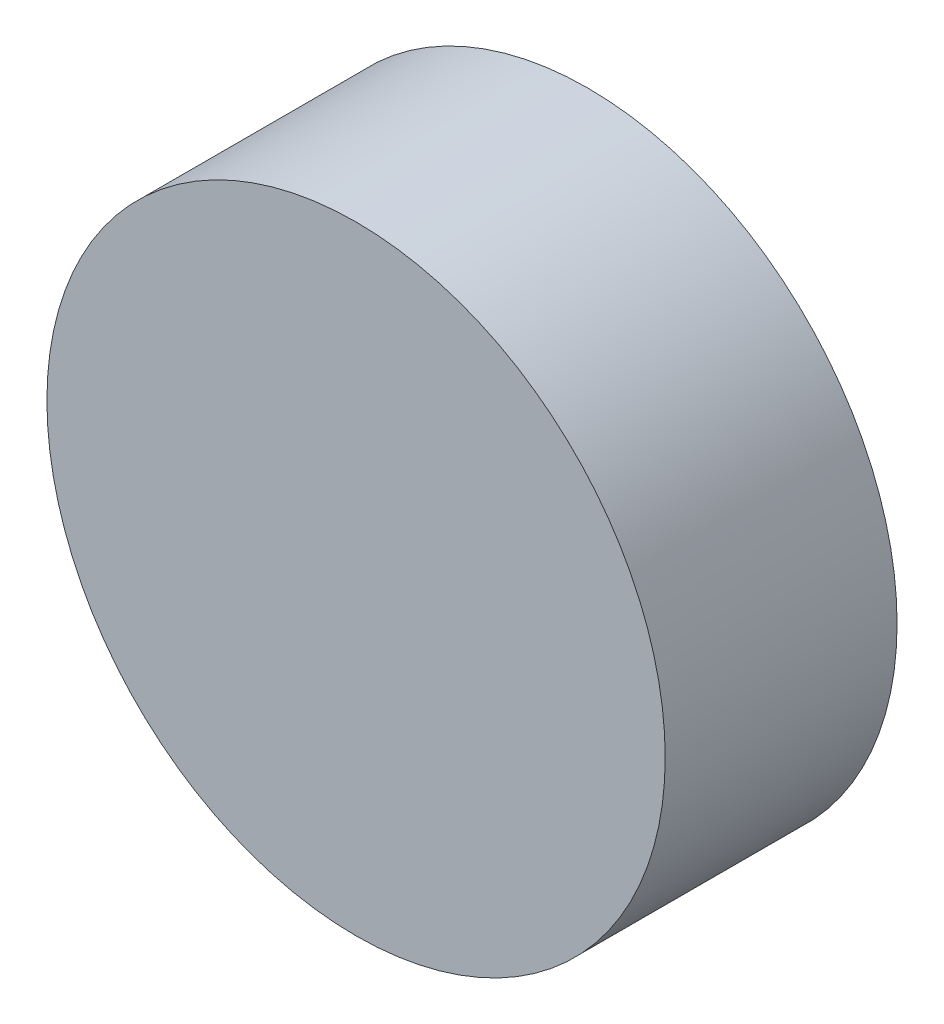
ISO-10303-21;
HEADER;
FILE_DESCRIPTION(('STEP AP214'),'2;1');
FILE_NAME('part.step','',(''),(''),'','','');
FILE_SCHEMA(('AUTOMOTIVE_DESIGN { 1 0 10303 214 1 1 1 1 }'));
ENDSEC;
DATA;
#1=APPLICATION_CONTEXT('core data for automotive mechanical design processes');
#2=APPLICATION_PROTOCOL_DEFINITION('international standard','automotive_design',2000,#1);
#3=PRODUCT_CONTEXT('',#1,'mechanical');
#4=PRODUCT('Part','Part','',(#3));
#5=PRODUCT_RELATED_PRODUCT_CATEGORY('part','',(#4));
#6=PRODUCT_DEFINITION_FORMATION('','',#4);
#7=PRODUCT_DEFINITION_CONTEXT('part definition',#1,'design');
#8=PRODUCT_DEFINITION('design','',#6,#7);
#9=PRODUCT_DEFINITION_SHAPE('','',#8);
#10=(LENGTH_UNIT() NAMED_UNIT(*) SI_UNIT(.MILLI.,.METRE.));
#11=(NAMED_UNIT(*) PLANE_ANGLE_UNIT() SI_UNIT($,.RADIAN.));
#12=(NAMED_UNIT(*) SI_UNIT($,.STERADIAN.) SOLID_ANGLE_UNIT());
#13=UNCERTAINTY_MEASURE_WITH_UNIT(LENGTH_MEASURE(1.E-05),#10,'distance_accuracy_value','');
#14=(GEOMETRIC_REPRESENTATION_CONTEXT(3) GLOBAL_UNCERTAINTY_ASSIGNED_CONTEXT((#13)) GLOBAL_UNIT_ASSIGNED_CONTEXT((#10,
#11,#12)) REPRESENTATION_CONTEXT('',''));
#15=CARTESIAN_POINT('',(0.,0.,0.));
#16=DIRECTION('',(0.,0.,1.));
#17=DIRECTION('',(1.,0.,0.));
#18=AXIS2_PLACEMENT_3D('',#15,#16,#17);
#19=CARTESIAN_POINT('',(0.,0.,0.));
#20=DIRECTION('',(0.,0.,-1.));
#21=DIRECTION('',(-1.,0.,0.));
#22=AXIS2_PLACEMENT_3D('',#19,#20,#21);
#23=CYLINDRICAL_SURFACE('',#22,8.);
#24=CARTESIAN_POINT('',(0.,0.,0.));
#25=DIRECTION('',(0.,0.,1.));
#26=DIRECTION('',(1.,0.,0.));
#27=AXIS2_PLACEMENT_3D('',#24,#25,#26);
#28=CIRCLE('',#27,8.);
#29=CARTESIAN_POINT('',(8.,0.,0.));
#30=VERTEX_POINT('',#29);
#31=EDGE_CURVE('E10',#30,#30,#28,.T.);
#32=ORIENTED_EDGE('',*,*,#31,.F.);
#33=EDGE_LOOP('',(#32));
#34=FACE_BOUND('',#33,.T.);
#35=CARTESIAN_POINT('',(0.,0.,-6.));
#36=DIRECTION('',(0.,0.,1.));
#37=DIRECTION('',(1.,0.,0.));
#38=AXIS2_PLACEMENT_3D('',#35,#36,#37);
#39=CIRCLE('',#38,8.);
#40=CARTESIAN_POINT('',(8.,0.,-6.));
#41=VERTEX_POINT('',#40);
#42=EDGE_CURVE('E44',#41,#41,#39,.T.);
#43=ORIENTED_EDGE('',*,*,#42,.T.);
#44=EDGE_LOOP('',(#43));
#45=FACE_BOUND('',#44,.T.);
#46=ADVANCED_FACE('F41',(#34,#45),#23,.T.);
#47=CARTESIAN_POINT('',(0.,0.,0.));
#48=DIRECTION('',(0.,0.,1.));
#49=DIRECTION('',(1.,0.,0.));
#50=AXIS2_PLACEMENT_3D('',#47,#48,#49);
#51=PLANE('',#50);
#52=ORIENTED_EDGE('',*,*,#31,.T.);
#53=EDGE_LOOP('',(#52));
#54=FACE_BOUND('',#53,.T.);
#55=ADVANCED_FACE('F56',(#54),#51,.T.);
#56=CARTESIAN_POINT('',(0.,0.,-6.));
#57=DIRECTION('',(0.,0.,1.));
#58=DIRECTION('',(1.,0.,0.));
#59=AXIS2_PLACEMENT_3D('',#56,#57,#58);
#60=PLANE('',#59);
#61=ORIENTED_EDGE('',*,*,#42,.F.);
#62=EDGE_LOOP('',(#61));
#63=FACE_BOUND('',#62,.T.);
#64=ADVANCED_FACE('F54',(#63),#60,.F.);
#65=CLOSED_SHELL('',(#46,#55,#64));
#66=MANIFOLD_SOLID_BREP('B2',#65);
#67=ADVANCED_BREP_SHAPE_REPRESENTATION('',(#18,#66),#14);
#68=SHAPE_DEFINITION_REPRESENTATION(#9,#67);
ENDSEC;
END-ISO-10303-21;
